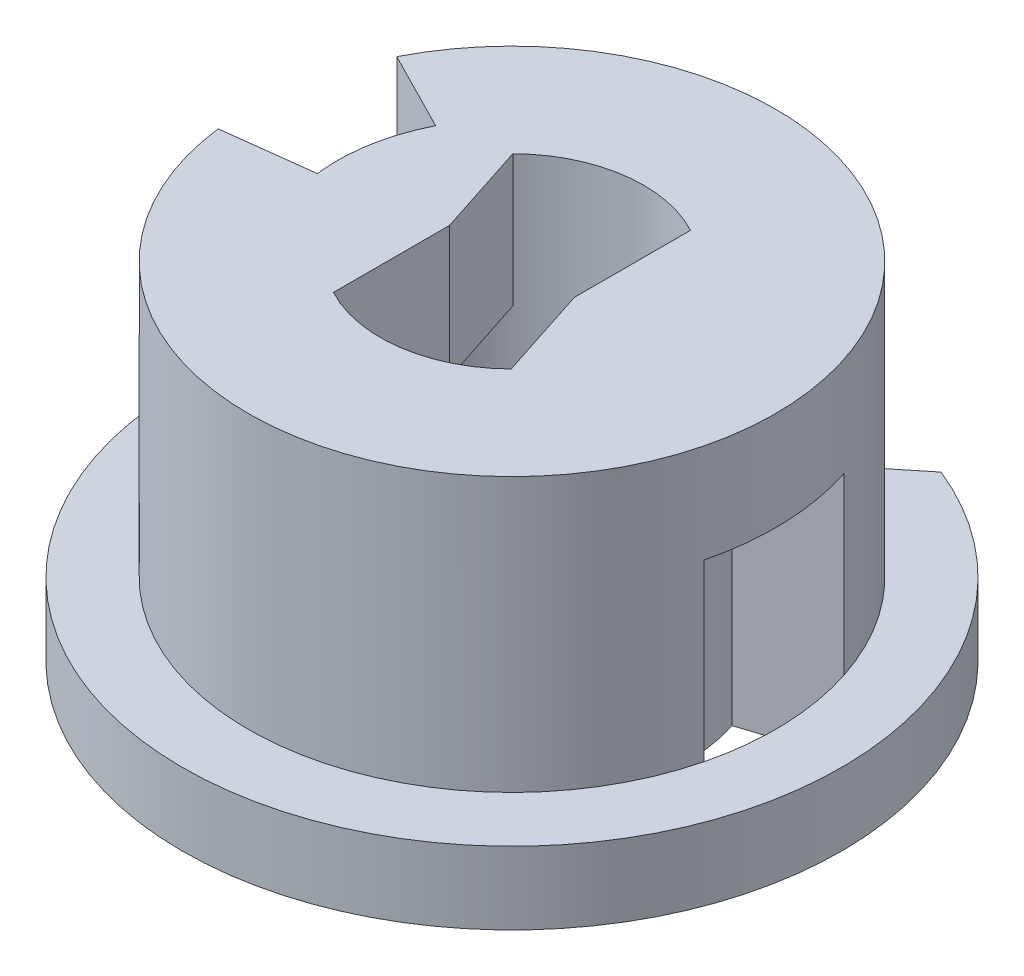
ISO-10303-21;
HEADER;
FILE_DESCRIPTION(('STEP AP214'),'2;1');
FILE_NAME('part.step','',(''),(''),'','','');
FILE_SCHEMA(('AUTOMOTIVE_DESIGN { 1 0 10303 214 1 1 1 1 }'));
ENDSEC;
DATA;
#1=APPLICATION_CONTEXT('core data for automotive mechanical design processes');
#2=APPLICATION_PROTOCOL_DEFINITION('international standard','automotive_design',2000,#1);
#3=PRODUCT_CONTEXT('',#1,'mechanical');
#4=PRODUCT('Part','Part','',(#3));
#5=PRODUCT_RELATED_PRODUCT_CATEGORY('part','',(#4));
#6=PRODUCT_DEFINITION_FORMATION('','',#4);
#7=PRODUCT_DEFINITION_CONTEXT('part definition',#1,'design');
#8=PRODUCT_DEFINITION('design','',#6,#7);
#9=PRODUCT_DEFINITION_SHAPE('','',#8);
#10=(LENGTH_UNIT() NAMED_UNIT(*) SI_UNIT(.MILLI.,.METRE.));
#11=(NAMED_UNIT(*) PLANE_ANGLE_UNIT() SI_UNIT($,.RADIAN.));
#12=(NAMED_UNIT(*) SI_UNIT($,.STERADIAN.) SOLID_ANGLE_UNIT());
#13=UNCERTAINTY_MEASURE_WITH_UNIT(LENGTH_MEASURE(1.E-05),#10,'distance_accuracy_value','');
#14=(GEOMETRIC_REPRESENTATION_CONTEXT(3) GLOBAL_UNCERTAINTY_ASSIGNED_CONTEXT((#13)) GLOBAL_UNIT_ASSIGNED_CONTEXT((#10,
#11,#12)) REPRESENTATION_CONTEXT('',''));
#15=CARTESIAN_POINT('',(0.,0.,0.));
#16=DIRECTION('',(0.,0.,1.));
#17=DIRECTION('',(1.,0.,0.));
#18=AXIS2_PLACEMENT_3D('',#15,#16,#17);
#19=CARTESIAN_POINT('',(0.,6.5,0.));
#20=DIRECTION('',(0.,-1.,0.));
#21=DIRECTION('',(0.,0.,-1.));
#22=AXIS2_PLACEMENT_3D('',#19,#20,#21);
#23=PLANE('',#22);
#24=DIRECTION('',(0.,0.,-1.));
#25=VECTOR('',#24,1.);
#26=CARTESIAN_POINT('',(-1.89263200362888,6.5,0.));
#27=LINE('',#26,#25);
#28=CARTESIAN_POINT('',(-1.89263200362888,6.5,3.52391034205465));
#29=VERTEX_POINT('',#28);
#30=CARTESIAN_POINT('',(-1.89263200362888,6.5,0.));
#31=VERTEX_POINT('',#30);
#32=EDGE_CURVE('E12',#29,#31,#27,.T.);
#33=ORIENTED_EDGE('',*,*,#32,.F.);
#34=CARTESIAN_POINT('',(0.,6.5,0.));
#35=DIRECTION('',(0.,-1.,0.));
#36=DIRECTION('',(0.,0.,-1.));
#37=AXIS2_PLACEMENT_3D('',#34,#35,#36);
#38=CIRCLE('',#37,4.);
#39=CARTESIAN_POINT('',(-2.81574572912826,6.5,-2.84105191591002));
#40=VERTEX_POINT('',#39);
#41=EDGE_CURVE('E659',#29,#40,#38,.T.);
#42=ORIENTED_EDGE('',*,*,#41,.T.);
#43=DIRECTION('',(-0.309016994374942,0.,-0.951056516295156));
#44=VECTOR('',#43,1.);
#45=CARTESIAN_POINT('',(-1.71190172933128,6.5,0.556230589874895));
#46=LINE('',#45,#44);
#47=EDGE_CURVE('E398',#31,#40,#46,.T.);
#48=ORIENTED_EDGE('',*,*,#47,.F.);
#49=EDGE_LOOP('',(#33,#42,#48));
#50=FACE_BOUND('',#49,.T.);
#51=ADVANCED_FACE('F390',(#50),#23,.T.);
#52=CARTESIAN_POINT('',(0.,2.2,0.));
#53=DIRECTION('',(0.,1.,0.));
#54=DIRECTION('',(0.,0.,1.));
#55=AXIS2_PLACEMENT_3D('',#52,#53,#54);
#56=PLANE('',#55);
#57=CARTESIAN_POINT('',(0.,2.2,0.));
#58=DIRECTION('',(0.,1.,0.));
#59=DIRECTION('',(0.,0.,1.));
#60=AXIS2_PLACEMENT_3D('',#57,#58,#59);
#61=CIRCLE('',#60,10.);
#62=CARTESIAN_POINT('',(-7.09145243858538,2.2,-7.05062424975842));
#63=VERTEX_POINT('',#62);
#64=CARTESIAN_POINT('',(3.74606593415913,2.2,-9.27183854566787));
#65=VERTEX_POINT('',#64);
#66=EDGE_CURVE('E727',#63,#65,#61,.T.);
#67=ORIENTED_EDGE('',*,*,#66,.T.);
#68=DIRECTION('',(-0.777145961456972,0.,0.629320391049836));
#69=VECTOR('',#68,1.);
#70=CARTESIAN_POINT('',(-3.05100579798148,2.2,-3.7676783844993));
#71=LINE('',#70,#69);
#72=CARTESIAN_POINT('',(1.89447433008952,2.2,-7.77244922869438));
#73=VERTEX_POINT('',#72);
#74=EDGE_CURVE('E682',#65,#73,#71,.T.);
#75=ORIENTED_EDGE('',*,*,#74,.T.);
#76=CARTESIAN_POINT('',(0.,2.2,0.));
#77=DIRECTION('',(0.,1.,0.));
#78=DIRECTION('',(0.,0.,1.));
#79=AXIS2_PLACEMENT_3D('',#76,#77,#78);
#80=CIRCLE('',#79,8.);
#81=CARTESIAN_POINT('',(7.60845213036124,2.2,-2.47213595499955));
#82=VERTEX_POINT('',#81);
#83=EDGE_CURVE('E721',#82,#73,#80,.T.);
#84=ORIENTED_EDGE('',*,*,#83,.F.);
#85=CARTESIAN_POINT('',(7.76236581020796,2.2,1.93537516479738));
#86=VERTEX_POINT('',#85);
#87=EDGE_CURVE('E564',#86,#82,#80,.T.);
#88=ORIENTED_EDGE('',*,*,#87,.F.);
#89=CARTESIAN_POINT('',(-4.96171125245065,2.2,-6.27546185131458));
#90=VERTEX_POINT('',#89);
#91=EDGE_CURVE('E717',#90,#86,#80,.T.);
#92=ORIENTED_EDGE('',*,*,#91,.F.);
#93=DIRECTION('',(-0.939692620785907,0.,-0.342020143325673));
#94=VECTOR('',#93,1.);
#95=CARTESIAN_POINT('',(1.43648460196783,2.2,-3.94670900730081));
#96=LINE('',#95,#94);
#97=EDGE_CURVE('E711',#90,#63,#96,.T.);
#98=ORIENTED_EDGE('',*,*,#97,.T.);
#99=EDGE_LOOP('',(#67,#75,#84,#88,#92,#98));
#100=FACE_BOUND('',#99,.T.);
#101=ADVANCED_FACE('F793',(#100),#56,.T.);
#102=CARTESIAN_POINT('',(0.,2.2,0.));
#103=DIRECTION('',(0.,-1.,0.));
#104=DIRECTION('',(0.,0.,-1.));
#105=AXIS2_PLACEMENT_3D('',#102,#103,#104);
#106=CYLINDRICAL_SURFACE('',#105,10.);
#107=DIRECTION('',(0.,-1.,0.));
#108=VECTOR('',#107,1.);
#109=CARTESIAN_POINT('',(3.74606593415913,3.2,-9.27183854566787));
#110=LINE('',#109,#108);
#111=CARTESIAN_POINT('',(3.74606593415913,0.,-9.27183854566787));
#112=VERTEX_POINT('',#111);
#113=EDGE_CURVE('E668',#65,#112,#110,.T.);
#114=ORIENTED_EDGE('',*,*,#113,.F.);
#115=ORIENTED_EDGE('',*,*,#66,.F.);
#116=DIRECTION('',(0.,-1.,0.));
#117=VECTOR('',#116,1.);
#118=CARTESIAN_POINT('',(-7.09145243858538,3.2,-7.05062424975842));
#119=LINE('',#118,#117);
#120=CARTESIAN_POINT('',(-7.09145243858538,0.,-7.05062424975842));
#121=VERTEX_POINT('',#120);
#122=EDGE_CURVE('E702',#63,#121,#119,.T.);
#123=ORIENTED_EDGE('',*,*,#122,.T.);
#124=CARTESIAN_POINT('',(0.,0.,0.));
#125=DIRECTION('',(0.,1.,0.));
#126=DIRECTION('',(0.,0.,1.));
#127=AXIS2_PLACEMENT_3D('',#124,#125,#126);
#128=CIRCLE('',#127,10.);
#129=EDGE_CURVE('E724',#121,#112,#128,.T.);
#130=ORIENTED_EDGE('',*,*,#129,.T.);
#131=EDGE_LOOP('',(#114,#115,#123,#130));
#132=FACE_BOUND('',#131,.T.);
#133=ADVANCED_FACE('F392',(#132),#106,.T.);
#134=CARTESIAN_POINT('',(0.,0.,0.));
#135=DIRECTION('',(0.,1.,0.));
#136=DIRECTION('',(0.,0.,1.));
#137=AXIS2_PLACEMENT_3D('',#134,#135,#136);
#138=PLANE('',#137);
#139=DIRECTION('',(0.951056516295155,0.,-0.309016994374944));
#140=VECTOR('',#139,1.);
#141=CARTESIAN_POINT('',(5.04059953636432,0.,-1.6377900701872));
#142=LINE('',#141,#140);
#143=CARTESIAN_POINT('',(5.04059953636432,0.,-1.6377900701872));
#144=VERTEX_POINT('',#143);
#145=CARTESIAN_POINT('',(7.60845213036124,0.,-2.47213595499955));
#146=VERTEX_POINT('',#145);
#147=EDGE_CURVE('E571',#144,#146,#142,.T.);
#148=ORIENTED_EDGE('',*,*,#147,.F.);
#149=CARTESIAN_POINT('',(0.,0.,0.));
#150=DIRECTION('',(0.,1.,0.));
#151=DIRECTION('',(0.,0.,-1.));
#152=AXIS2_PLACEMENT_3D('',#149,#150,#151);
#153=CIRCLE('',#152,5.3);
#154=CARTESIAN_POINT('',(5.14256734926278,0.,1.28218604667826));
#155=VERTEX_POINT('',#154);
#156=EDGE_CURVE('E405',#155,#144,#153,.T.);
#157=ORIENTED_EDGE('',*,*,#156,.F.);
#158=DIRECTION('',(-0.970295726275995,0.,-0.241921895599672));
#159=VECTOR('',#158,1.);
#160=CARTESIAN_POINT('',(5.14256734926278,0.,1.28218604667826));
#161=LINE('',#160,#159);
#162=CARTESIAN_POINT('',(7.76236581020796,0.,1.93537516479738));
#163=VERTEX_POINT('',#162);
#164=EDGE_CURVE('E578',#163,#155,#161,.T.);
#165=ORIENTED_EDGE('',*,*,#164,.F.);
#166=CARTESIAN_POINT('',(0.,0.,0.));
#167=DIRECTION('',(0.,-1.,0.));
#168=DIRECTION('',(0.,0.,-1.));
#169=AXIS2_PLACEMENT_3D('',#166,#167,#168);
#170=CIRCLE('',#169,8.);
#171=EDGE_CURVE('E561',#146,#163,#170,.T.);
#172=ORIENTED_EDGE('',*,*,#171,.F.);
#173=EDGE_LOOP('',(#148,#157,#165,#172));
#174=FACE_BOUND('',#173,.T.);
#175=CARTESIAN_POINT('',(0.,0.,0.));
#176=DIRECTION('',(0.,-1.,0.));
#177=DIRECTION('',(0.,0.,-1.));
#178=AXIS2_PLACEMENT_3D('',#175,#176,#177);
#179=CIRCLE('',#178,4.);
#180=CARTESIAN_POINT('',(0.,0.,-4.));
#181=VERTEX_POINT('',#180);
#182=EDGE_CURVE('E646',#181,#181,#179,.T.);
#183=ORIENTED_EDGE('',*,*,#182,.F.);
#184=EDGE_LOOP('',(#183));
#185=FACE_BOUND('',#184,.T.);
#186=DIRECTION('',(0.777145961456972,0.,-0.629320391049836));
#187=VECTOR('',#186,1.);
#188=CARTESIAN_POINT('',(7.7777832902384,0.,-12.536658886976));
#189=LINE('',#188,#187);
#190=CARTESIAN_POINT('',(0.340457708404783,0.,-6.51403138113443));
#191=VERTEX_POINT('',#190);
#192=EDGE_CURVE('E667',#191,#112,#189,.T.);
#193=ORIENTED_EDGE('',*,*,#192,.T.);
#194=ORIENTED_EDGE('',*,*,#129,.F.);
#195=DIRECTION('',(0.939692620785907,0.,0.342020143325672));
#196=VECTOR('',#195,1.);
#197=CARTESIAN_POINT('',(-5.67963105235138,0.,-6.53676328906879));
#198=LINE('',#197,#196);
#199=CARTESIAN_POINT('',(-4.15372438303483,0.,-5.98137868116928));
#200=VERTEX_POINT('',#199);
#201=EDGE_CURVE('E693',#121,#200,#198,.T.);
#202=ORIENTED_EDGE('',*,*,#201,.T.);
#203=DIRECTION('',(0.342020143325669,0.,-0.939692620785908));
#204=VECTOR('',#203,1.);
#205=CARTESIAN_POINT('',(1.5259066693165,0.,-21.5860367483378));
#206=LINE('',#205,#204);
#207=CARTESIAN_POINT('',(-2.92862723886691,0.,-9.34730542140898));
#208=VERTEX_POINT('',#207);
#209=EDGE_CURVE('E690',#200,#208,#206,.T.);
#210=ORIENTED_EDGE('',*,*,#209,.T.);
#211=CARTESIAN_POINT('',(-2.45878092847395,0.,-9.17629534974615));
#212=DIRECTION('',(0.,-1.,0.));
#213=DIRECTION('',(0.,0.,-1.));
#214=AXIS2_PLACEMENT_3D('',#211,#212,#213);
#215=CIRCLE('',#214,0.5);
#216=CARTESIAN_POINT('',(-2.07020794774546,0.,-9.49095554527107));
#217=VERTEX_POINT('',#216);
#218=EDGE_CURVE('E687',#217,#208,#215,.F.);
#219=ORIENTED_EDGE('',*,*,#218,.F.);
#220=DIRECTION('',(-0.629320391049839,0.,-0.77714596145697));
#221=VECTOR('',#220,1.);
#222=CARTESIAN_POINT('',(-7.43732558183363,0.,-16.1187938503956));
#223=LINE('',#222,#221);
#224=EDGE_CURVE('E675',#191,#217,#223,.T.);
#225=ORIENTED_EDGE('',*,*,#224,.F.);
#226=EDGE_LOOP('',(#193,#194,#202,#210,#219,#225));
#227=FACE_BOUND('',#226,.T.);
#228=ADVANCED_FACE('F575',(#174,#185,#227),#138,.F.);
#229=DIRECTION('',(0.629320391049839,0.,0.77714596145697));
#230=VECTOR('',#229,1.);
#231=CARTESIAN_POINT('',(3.39146350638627,2.2,-2.74635299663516));
#232=LINE('',#231,#230);
#233=CARTESIAN_POINT('',(-2.07020794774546,2.2,-9.49095554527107));
#234=VERTEX_POINT('',#233);
#235=CARTESIAN_POINT('',(-0.828059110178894,2.2,-7.9570294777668));
#236=VERTEX_POINT('',#235);
#237=EDGE_CURVE('E685',#234,#236,#232,.T.);
#238=ORIENTED_EDGE('',*,*,#237,.F.);
#239=CARTESIAN_POINT('',(-2.45878092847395,2.2,-9.17629534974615));
#240=DIRECTION('',(0.,1.,0.));
#241=DIRECTION('',(0.,0.,1.));
#242=AXIS2_PLACEMENT_3D('',#239,#240,#241);
#243=CIRCLE('',#242,0.5);
#244=CARTESIAN_POINT('',(-2.92862723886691,2.2,-9.34730542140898));
#245=VERTEX_POINT('',#244);
#246=EDGE_CURVE('E714',#245,#234,#243,.F.);
#247=ORIENTED_EDGE('',*,*,#246,.F.);
#248=DIRECTION('',(-0.342020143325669,0.,0.939692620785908));
#249=VECTOR('',#248,1.);
#250=CARTESIAN_POINT('',(-5.59020898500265,2.2,-2.03466967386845));
#251=LINE('',#250,#249);
#252=CARTESIAN_POINT('',(-3.76081095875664,2.2,-7.0608994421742));
#253=VERTEX_POINT('',#252);
#254=EDGE_CURVE('E705',#245,#253,#251,.T.);
#255=ORIENTED_EDGE('',*,*,#254,.T.);
#256=EDGE_CURVE('E716',#236,#253,#80,.T.);
#257=ORIENTED_EDGE('',*,*,#256,.F.);
#258=EDGE_LOOP('',(#238,#247,#255,#257));
#259=FACE_BOUND('',#258,.T.);
#260=ADVANCED_FACE('F799',(#259),#56,.T.);
#261=CARTESIAN_POINT('',(0.,10.5,0.));
#262=DIRECTION('',(0.,-1.,0.));
#263=DIRECTION('',(0.,0.,-1.));
#264=AXIS2_PLACEMENT_3D('',#261,#262,#263);
#265=CYLINDRICAL_SURFACE('',#264,8.);
#266=ORIENTED_EDGE('',*,*,#91,.T.);
#267=DIRECTION('',(0.,-1.,0.));
#268=VECTOR('',#267,1.);
#269=CARTESIAN_POINT('',(7.76236581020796,7.5,1.93537516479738));
#270=LINE('',#269,#268);
#271=CARTESIAN_POINT('',(7.76236581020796,7.5,1.93537516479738));
#272=VERTEX_POINT('',#271);
#273=EDGE_CURVE('E594',#272,#86,#270,.T.);
#274=ORIENTED_EDGE('',*,*,#273,.F.);
#275=CARTESIAN_POINT('',(0.,7.5,0.));
#276=DIRECTION('',(0.,-1.,0.));
#277=DIRECTION('',(0.,0.,-1.));
#278=AXIS2_PLACEMENT_3D('',#275,#276,#277);
#279=CIRCLE('',#278,8.);
#280=CARTESIAN_POINT('',(7.60845213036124,7.5,-2.47213595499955));
#281=VERTEX_POINT('',#280);
#282=EDGE_CURVE('E586',#281,#272,#279,.T.);
#283=ORIENTED_EDGE('',*,*,#282,.F.);
#284=DIRECTION('',(0.,-1.,0.));
#285=VECTOR('',#284,1.);
#286=CARTESIAN_POINT('',(7.60845213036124,7.5,-2.47213595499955));
#287=LINE('',#286,#285);
#288=EDGE_CURVE('E567',#281,#82,#287,.T.);
#289=ORIENTED_EDGE('',*,*,#288,.T.);
#290=ORIENTED_EDGE('',*,*,#83,.T.);
#291=DIRECTION('',(0.,-1.,0.));
#292=VECTOR('',#291,1.);
#293=CARTESIAN_POINT('',(1.89447433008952,10.5,-7.77244922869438));
#294=LINE('',#293,#292);
#295=CARTESIAN_POINT('',(1.89447433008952,3.2,-7.77244922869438));
#296=VERTEX_POINT('',#295);
#297=EDGE_CURVE('E740',#296,#73,#294,.T.);
#298=ORIENTED_EDGE('',*,*,#297,.F.);
#299=CARTESIAN_POINT('',(0.,3.2,0.));
#300=DIRECTION('',(0.,-1.,0.));
#301=DIRECTION('',(0.,0.,-1.));
#302=AXIS2_PLACEMENT_3D('',#299,#300,#301);
#303=CIRCLE('',#302,8.);
#304=CARTESIAN_POINT('',(-0.828059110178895,3.2,-7.9570294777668));
#305=VERTEX_POINT('',#304);
#306=EDGE_CURVE('E738',#305,#296,#303,.T.);
#307=ORIENTED_EDGE('',*,*,#306,.F.);
#308=DIRECTION('',(0.,-1.,0.));
#309=VECTOR('',#308,1.);
#310=CARTESIAN_POINT('',(-0.828059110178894,10.5,-7.9570294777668));
#311=LINE('',#310,#309);
#312=EDGE_CURVE('E743',#305,#236,#311,.T.);
#313=ORIENTED_EDGE('',*,*,#312,.T.);
#314=ORIENTED_EDGE('',*,*,#256,.T.);
#315=DIRECTION('',(0.,-1.,0.));
#316=VECTOR('',#315,1.);
#317=CARTESIAN_POINT('',(-3.76081095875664,10.5,-7.0608994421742));
#318=LINE('',#317,#316);
#319=CARTESIAN_POINT('',(-3.76081095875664,3.2,-7.0608994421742));
#320=VERTEX_POINT('',#319);
#321=EDGE_CURVE('E732',#320,#253,#318,.T.);
#322=ORIENTED_EDGE('',*,*,#321,.F.);
#323=CARTESIAN_POINT('',(0.,3.2,0.));
#324=DIRECTION('',(0.,-1.,0.));
#325=DIRECTION('',(0.,0.,-1.));
#326=AXIS2_PLACEMENT_3D('',#323,#324,#325);
#327=CIRCLE('',#326,8.);
#328=CARTESIAN_POINT('',(-4.96171125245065,3.2,-6.27546185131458));
#329=VERTEX_POINT('',#328);
#330=EDGE_CURVE('E730',#329,#320,#327,.T.);
#331=ORIENTED_EDGE('',*,*,#330,.F.);
#332=DIRECTION('',(0.,-1.,0.));
#333=VECTOR('',#332,1.);
#334=CARTESIAN_POINT('',(-4.96171125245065,10.5,-6.27546185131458));
#335=LINE('',#334,#333);
#336=EDGE_CURVE('E735',#90,#329,#335,.F.);
#337=ORIENTED_EDGE('',*,*,#336,.F.);
#338=EDGE_LOOP('',(#266,#274,#283,#289,#290,#298,#307,#313,#314,#322,#331,#337));
#339=FACE_BOUND('',#338,.T.);
#340=CARTESIAN_POINT('',(0.,10.5,0.));
#341=DIRECTION('',(0.,1.,0.));
#342=DIRECTION('',(0.,0.,1.));
#343=AXIS2_PLACEMENT_3D('',#340,#341,#342);
#344=CIRCLE('',#343,8.);
#345=CARTESIAN_POINT('',(-7.94036921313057,10.5,0.974954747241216));
#346=VERTEX_POINT('',#345);
#347=CARTESIAN_POINT('',(-7.12805219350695,10.5,-3.63192399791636));
#348=VERTEX_POINT('',#347);
#349=EDGE_CURVE('E720',#346,#348,#344,.T.);
#350=ORIENTED_EDGE('',*,*,#349,.F.);
#351=DIRECTION('',(0.,1.,0.));
#352=VECTOR('',#351,1.);
#353=CARTESIAN_POINT('',(-7.94036921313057,5.5,0.974954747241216));
#354=LINE('',#353,#352);
#355=CARTESIAN_POINT('',(-7.94036921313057,5.5,0.974954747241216));
#356=VERTEX_POINT('',#355);
#357=EDGE_CURVE('E620',#356,#346,#354,.T.);
#358=ORIENTED_EDGE('',*,*,#357,.F.);
#359=CARTESIAN_POINT('',(0.,5.5,0.));
#360=DIRECTION('',(0.,1.,0.));
#361=DIRECTION('',(0.,0.,1.));
#362=AXIS2_PLACEMENT_3D('',#359,#360,#361);
#363=CIRCLE('',#362,8.);
#364=CARTESIAN_POINT('',(-7.12805219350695,5.5,-3.63192399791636));
#365=VERTEX_POINT('',#364);
#366=EDGE_CURVE('E611',#365,#356,#363,.T.);
#367=ORIENTED_EDGE('',*,*,#366,.F.);
#368=DIRECTION('',(0.,1.,0.));
#369=VECTOR('',#368,1.);
#370=CARTESIAN_POINT('',(-7.12805219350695,5.5,-3.63192399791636));
#371=LINE('',#370,#369);
#372=EDGE_CURVE('E622',#365,#348,#371,.T.);
#373=ORIENTED_EDGE('',*,*,#372,.T.);
#374=EDGE_LOOP('',(#350,#358,#367,#373));
#375=FACE_BOUND('',#374,.T.);
#376=ADVANCED_FACE('F808',(#339,#375),#265,.T.);
#377=CARTESIAN_POINT('',(0.,10.5,0.));
#378=DIRECTION('',(0.,1.,0.));
#379=DIRECTION('',(0.,0.,1.));
#380=AXIS2_PLACEMENT_3D('',#377,#378,#379);
#381=PLANE('',#380);
#382=DIRECTION('',(0.992546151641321,0.,-0.121869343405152));
#383=VECTOR('',#382,1.);
#384=CARTESIAN_POINT('',(-5.260494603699,10.5,0.645907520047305));
#385=LINE('',#384,#383);
#386=CARTESIAN_POINT('',(-5.260494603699,10.5,0.645907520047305));
#387=VERTEX_POINT('',#386);
#388=EDGE_CURVE('E602',#346,#387,#385,.T.);
#389=ORIENTED_EDGE('',*,*,#388,.F.);
#390=ORIENTED_EDGE('',*,*,#349,.T.);
#391=DIRECTION('',(-0.891006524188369,0.,-0.453990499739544));
#392=VECTOR('',#391,1.);
#393=CARTESIAN_POINT('',(-4.72233457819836,10.5,-2.40614964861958));
#394=LINE('',#393,#392);
#395=CARTESIAN_POINT('',(-4.72233457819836,10.5,-2.40614964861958));
#396=VERTEX_POINT('',#395);
#397=EDGE_CURVE('E600',#396,#348,#394,.T.);
#398=ORIENTED_EDGE('',*,*,#397,.F.);
#399=CARTESIAN_POINT('',(0.,10.5,0.));
#400=DIRECTION('',(0.,-1.,0.));
#401=DIRECTION('',(0.,0.,1.));
#402=AXIS2_PLACEMENT_3D('',#399,#400,#401);
#403=CIRCLE('',#402,5.3);
#404=EDGE_CURVE('E593',#387,#396,#403,.T.);
#405=ORIENTED_EDGE('',*,*,#404,.F.);
#406=EDGE_LOOP('',(#389,#390,#398,#405));
#407=FACE_BOUND('',#406,.T.);
#408=CARTESIAN_POINT('',(0.,10.5,0.));
#409=DIRECTION('',(0.,1.,0.));
#410=DIRECTION('',(0.,0.,1.));
#411=AXIS2_PLACEMENT_3D('',#408,#409,#410);
#412=CIRCLE('',#411,4.);
#413=CARTESIAN_POINT('',(-1.89263200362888,10.5,3.52391034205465));
#414=VERTEX_POINT('',#413);
#415=CARTESIAN_POINT('',(2.81574572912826,10.5,2.84105191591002));
#416=VERTEX_POINT('',#415);
#417=EDGE_CURVE('E619',#414,#416,#412,.T.);
#418=ORIENTED_EDGE('',*,*,#417,.F.);
#419=DIRECTION('',(0.,0.,1.));
#420=VECTOR('',#419,1.);
#421=CARTESIAN_POINT('',(-1.89263200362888,10.5,0.));
#422=LINE('',#421,#420);
#423=CARTESIAN_POINT('',(-1.89263200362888,10.5,0.));
#424=VERTEX_POINT('',#423);
#425=EDGE_CURVE('E640',#424,#414,#422,.T.);
#426=ORIENTED_EDGE('',*,*,#425,.F.);
#427=DIRECTION('',(0.309016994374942,0.,0.951056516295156));
#428=VECTOR('',#427,1.);
#429=CARTESIAN_POINT('',(-2.81574572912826,10.5,-2.84105191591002));
#430=LINE('',#429,#428);
#431=CARTESIAN_POINT('',(-2.81574572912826,10.5,-2.84105191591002));
#432=VERTEX_POINT('',#431);
#433=EDGE_CURVE('E637',#432,#424,#430,.T.);
#434=ORIENTED_EDGE('',*,*,#433,.F.);
#435=CARTESIAN_POINT('',(0.,10.5,0.));
#436=DIRECTION('',(0.,1.,0.));
#437=DIRECTION('',(0.,0.,1.));
#438=AXIS2_PLACEMENT_3D('',#435,#436,#437);
#439=CIRCLE('',#438,4.);
#440=CARTESIAN_POINT('',(1.89263200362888,10.5,-3.52391034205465));
#441=VERTEX_POINT('',#440);
#442=EDGE_CURVE('E634',#441,#432,#439,.T.);
#443=ORIENTED_EDGE('',*,*,#442,.F.);
#444=DIRECTION('',(0.,0.,-1.));
#445=VECTOR('',#444,1.);
#446=CARTESIAN_POINT('',(1.89263200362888,10.5,0.));
#447=LINE('',#446,#445);
#448=CARTESIAN_POINT('',(1.89263200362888,10.5,0.));
#449=VERTEX_POINT('',#448);
#450=EDGE_CURVE('E631',#449,#441,#447,.T.);
#451=ORIENTED_EDGE('',*,*,#450,.F.);
#452=DIRECTION('',(-0.309016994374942,0.,-0.951056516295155));
#453=VECTOR('',#452,1.);
#454=CARTESIAN_POINT('',(2.81574572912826,10.5,2.84105191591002));
#455=LINE('',#454,#453);
#456=EDGE_CURVE('E628',#416,#449,#455,.T.);
#457=ORIENTED_EDGE('',*,*,#456,.F.);
#458=EDGE_LOOP('',(#418,#426,#434,#443,#451,#457));
#459=FACE_BOUND('',#458,.T.);
#460=ADVANCED_FACE('F775',(#407,#459),#381,.T.);
#461=CARTESIAN_POINT('',(0.,3.2,-22.1414213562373));
#462=DIRECTION('',(0.,-1.,0.));
#463=DIRECTION('',(0.,0.,-1.));
#464=AXIS2_PLACEMENT_3D('',#461,#462,#463);
#465=PLANE('',#464);
#466=ORIENTED_EDGE('',*,*,#330,.T.);
#467=DIRECTION('',(0.342020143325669,0.,-0.939692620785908));
#468=VECTOR('',#467,1.);
#469=CARTESIAN_POINT('',(1.5259066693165,3.2,-21.5860367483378));
#470=LINE('',#469,#468);
#471=CARTESIAN_POINT('',(-4.15372438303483,3.2,-5.98137868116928));
#472=VERTEX_POINT('',#471);
#473=EDGE_CURVE('E696',#472,#320,#470,.T.);
#474=ORIENTED_EDGE('',*,*,#473,.F.);
#475=DIRECTION('',(0.939692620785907,0.,0.342020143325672));
#476=VECTOR('',#475,1.);
#477=CARTESIAN_POINT('',(-5.67963105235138,3.2,-6.53676328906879));
#478=LINE('',#477,#476);
#479=EDGE_CURVE('E699',#329,#472,#478,.T.);
#480=ORIENTED_EDGE('',*,*,#479,.F.);
#481=EDGE_LOOP('',(#466,#474,#480));
#482=FACE_BOUND('',#481,.T.);
#483=ADVANCED_FACE('F847',(#482),#465,.T.);
#484=CARTESIAN_POINT('',(-5.67963105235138,3.2,-6.53676328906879));
#485=DIRECTION('',(0.342020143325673,0.,-0.939692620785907));
#486=DIRECTION('',(-0.939692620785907,0.,-0.342020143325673));
#487=AXIS2_PLACEMENT_3D('',#484,#485,#486);
#488=PLANE('',#487);
#489=ORIENTED_EDGE('',*,*,#336,.T.);
#490=ORIENTED_EDGE('',*,*,#479,.T.);
#491=DIRECTION('',(0.,-1.,0.));
#492=VECTOR('',#491,1.);
#493=CARTESIAN_POINT('',(-4.15372438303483,3.2,-5.98137868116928));
#494=LINE('',#493,#492);
#495=EDGE_CURVE('E706',#472,#200,#494,.T.);
#496=ORIENTED_EDGE('',*,*,#495,.T.);
#497=ORIENTED_EDGE('',*,*,#201,.F.);
#498=ORIENTED_EDGE('',*,*,#122,.F.);
#499=ORIENTED_EDGE('',*,*,#97,.F.);
#500=EDGE_LOOP('',(#489,#490,#496,#497,#498,#499));
#501=FACE_BOUND('',#500,.T.);
#502=ADVANCED_FACE('F849',(#501),#488,.T.);
#503=CARTESIAN_POINT('',(1.5259066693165,3.2,-21.5860367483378));
#504=DIRECTION('',(-0.939692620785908,0.,-0.342020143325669));
#505=DIRECTION('',(-0.342020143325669,0.,0.939692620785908));
#506=AXIS2_PLACEMENT_3D('',#503,#504,#505);
#507=PLANE('',#506);
#508=DIRECTION('',(0.,-1.,0.));
#509=VECTOR('',#508,1.);
#510=CARTESIAN_POINT('',(-2.92862723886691,3.2,-9.34730542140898));
#511=LINE('',#510,#509);
#512=EDGE_CURVE('E701',#245,#208,#511,.T.);
#513=ORIENTED_EDGE('',*,*,#512,.T.);
#514=ORIENTED_EDGE('',*,*,#209,.F.);
#515=ORIENTED_EDGE('',*,*,#495,.F.);
#516=ORIENTED_EDGE('',*,*,#473,.T.);
#517=ORIENTED_EDGE('',*,*,#321,.T.);
#518=ORIENTED_EDGE('',*,*,#254,.F.);
#519=EDGE_LOOP('',(#513,#514,#515,#516,#517,#518));
#520=FACE_BOUND('',#519,.T.);
#521=ADVANCED_FACE('F840',(#520),#507,.T.);
#522=CARTESIAN_POINT('',(-2.45878092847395,3.2,-9.17629534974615));
#523=DIRECTION('',(0.,-1.,0.));
#524=DIRECTION('',(0.,0.,-1.));
#525=AXIS2_PLACEMENT_3D('',#522,#523,#524);
#526=CYLINDRICAL_SURFACE('',#525,0.5);
#527=ORIENTED_EDGE('',*,*,#246,.T.);
#528=DIRECTION('',(0.,-1.,0.));
#529=VECTOR('',#528,1.);
#530=CARTESIAN_POINT('',(-2.07020794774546,3.2,-9.49095554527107));
#531=LINE('',#530,#529);
#532=EDGE_CURVE('E664',#234,#217,#531,.T.);
#533=ORIENTED_EDGE('',*,*,#532,.T.);
#534=ORIENTED_EDGE('',*,*,#218,.T.);
#535=ORIENTED_EDGE('',*,*,#512,.F.);
#536=EDGE_LOOP('',(#527,#533,#534,#535));
#537=FACE_BOUND('',#536,.T.);
#538=ADVANCED_FACE('F838',(#537),#526,.T.);
#539=CARTESIAN_POINT('',(0.,3.2,-22.1414213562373));
#540=DIRECTION('',(0.,-1.,0.));
#541=DIRECTION('',(0.,0.,-1.));
#542=AXIS2_PLACEMENT_3D('',#539,#540,#541);
#543=PLANE('',#542);
#544=ORIENTED_EDGE('',*,*,#306,.T.);
#545=DIRECTION('',(0.777145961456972,0.,-0.629320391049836));
#546=VECTOR('',#545,1.);
#547=CARTESIAN_POINT('',(7.7777832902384,3.2,-12.536658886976));
#548=LINE('',#547,#546);
#549=CARTESIAN_POINT('',(0.340457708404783,3.2,-6.51403138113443));
#550=VERTEX_POINT('',#549);
#551=EDGE_CURVE('E670',#550,#296,#548,.T.);
#552=ORIENTED_EDGE('',*,*,#551,.F.);
#553=DIRECTION('',(-0.629320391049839,0.,-0.77714596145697));
#554=VECTOR('',#553,1.);
#555=CARTESIAN_POINT('',(-7.43732558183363,3.2,-16.1187938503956));
#556=LINE('',#555,#554);
#557=EDGE_CURVE('E663',#550,#305,#556,.T.);
#558=ORIENTED_EDGE('',*,*,#557,.T.);
#559=EDGE_LOOP('',(#544,#552,#558));
#560=FACE_BOUND('',#559,.T.);
#561=ADVANCED_FACE('F829',(#560),#543,.T.);
#562=CARTESIAN_POINT('',(-7.43732558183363,3.2,-16.1187938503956));
#563=DIRECTION('',(-0.77714596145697,0.,0.629320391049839));
#564=DIRECTION('',(0.629320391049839,0.,0.77714596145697));
#565=AXIS2_PLACEMENT_3D('',#562,#563,#564);
#566=PLANE('',#565);
#567=ORIENTED_EDGE('',*,*,#237,.T.);
#568=ORIENTED_EDGE('',*,*,#312,.F.);
#569=ORIENTED_EDGE('',*,*,#557,.F.);
#570=DIRECTION('',(0.,-1.,0.));
#571=VECTOR('',#570,1.);
#572=CARTESIAN_POINT('',(0.340457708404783,3.2,-6.51403138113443));
#573=LINE('',#572,#571);
#574=EDGE_CURVE('E671',#550,#191,#573,.T.);
#575=ORIENTED_EDGE('',*,*,#574,.T.);
#576=ORIENTED_EDGE('',*,*,#224,.T.);
#577=ORIENTED_EDGE('',*,*,#532,.F.);
#578=EDGE_LOOP('',(#567,#568,#569,#575,#576,#577));
#579=FACE_BOUND('',#578,.T.);
#580=ADVANCED_FACE('F821',(#579),#566,.F.);
#581=CARTESIAN_POINT('',(7.7777832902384,3.2,-12.536658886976));
#582=DIRECTION('',(-0.629320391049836,0.,-0.777145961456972));
#583=DIRECTION('',(-0.777145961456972,0.,0.629320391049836));
#584=AXIS2_PLACEMENT_3D('',#581,#582,#583);
#585=PLANE('',#584);
#586=ORIENTED_EDGE('',*,*,#113,.T.);
#587=ORIENTED_EDGE('',*,*,#192,.F.);
#588=ORIENTED_EDGE('',*,*,#574,.F.);
#589=ORIENTED_EDGE('',*,*,#551,.T.);
#590=ORIENTED_EDGE('',*,*,#297,.T.);
#591=ORIENTED_EDGE('',*,*,#74,.F.);
#592=EDGE_LOOP('',(#586,#587,#588,#589,#590,#591));
#593=FACE_BOUND('',#592,.T.);
#594=ADVANCED_FACE('F788',(#593),#585,.T.);
#595=CARTESIAN_POINT('',(0.,6.5,0.));
#596=DIRECTION('',(0.,-1.,0.));
#597=DIRECTION('',(0.,0.,-1.));
#598=AXIS2_PLACEMENT_3D('',#595,#596,#597);
#599=CYLINDRICAL_SURFACE('',#598,4.);
#600=ORIENTED_EDGE('',*,*,#182,.T.);
#601=EDGE_LOOP('',(#600));
#602=FACE_BOUND('',#601,.T.);
#603=CARTESIAN_POINT('',(1.89263200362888,6.5,-3.52391034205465));
#604=VERTEX_POINT('',#603);
#605=CARTESIAN_POINT('',(2.81574572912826,6.5,2.84105191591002));
#606=VERTEX_POINT('',#605);
#607=EDGE_CURVE('E660',#604,#606,#38,.T.);
#608=ORIENTED_EDGE('',*,*,#607,.F.);
#609=DIRECTION('',(0.,1.,0.));
#610=VECTOR('',#609,1.);
#611=CARTESIAN_POINT('',(1.89263200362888,0.,-3.52391034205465));
#612=LINE('',#611,#610);
#613=EDGE_CURVE('E651',#604,#441,#612,.T.);
#614=ORIENTED_EDGE('',*,*,#613,.T.);
#615=ORIENTED_EDGE('',*,*,#442,.T.);
#616=DIRECTION('',(0.,1.,0.));
#617=VECTOR('',#616,1.);
#618=CARTESIAN_POINT('',(-2.81574572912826,0.,-2.84105191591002));
#619=LINE('',#618,#617);
#620=EDGE_CURVE('E649',#40,#432,#619,.T.);
#621=ORIENTED_EDGE('',*,*,#620,.F.);
#622=ORIENTED_EDGE('',*,*,#41,.F.);
#623=DIRECTION('',(0.,1.,0.));
#624=VECTOR('',#623,1.);
#625=CARTESIAN_POINT('',(-1.89263200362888,0.,3.52391034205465));
#626=LINE('',#625,#624);
#627=EDGE_CURVE('E644',#29,#414,#626,.T.);
#628=ORIENTED_EDGE('',*,*,#627,.T.);
#629=ORIENTED_EDGE('',*,*,#417,.T.);
#630=DIRECTION('',(0.,1.,0.));
#631=VECTOR('',#630,1.);
#632=CARTESIAN_POINT('',(2.81574572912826,0.,2.84105191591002));
#633=LINE('',#632,#631);
#634=EDGE_CURVE('E643',#606,#416,#633,.T.);
#635=ORIENTED_EDGE('',*,*,#634,.F.);
#636=EDGE_LOOP('',(#608,#614,#615,#621,#622,#628,#629,#635));
#637=FACE_BOUND('',#636,.T.);
#638=ADVANCED_FACE('F761',(#602,#637),#599,.F.);
#639=DIRECTION('',(0.,0.,1.));
#640=VECTOR('',#639,1.);
#641=CARTESIAN_POINT('',(1.89263200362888,6.5,0.));
#642=LINE('',#641,#640);
#643=CARTESIAN_POINT('',(1.89263200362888,6.5,0.));
#644=VERTEX_POINT('',#643);
#645=EDGE_CURVE('E748',#604,#644,#642,.T.);
#646=ORIENTED_EDGE('',*,*,#645,.F.);
#647=ORIENTED_EDGE('',*,*,#607,.T.);
#648=DIRECTION('',(0.309016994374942,0.,0.951056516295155));
#649=VECTOR('',#648,1.);
#650=CARTESIAN_POINT('',(1.71190172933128,6.5,-0.556230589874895));
#651=LINE('',#650,#649);
#652=EDGE_CURVE('E746',#644,#606,#651,.T.);
#653=ORIENTED_EDGE('',*,*,#652,.F.);
#654=EDGE_LOOP('',(#646,#647,#653));
#655=FACE_BOUND('',#654,.T.);
#656=ADVANCED_FACE('F780',(#655),#23,.T.);
#657=CARTESIAN_POINT('',(-1.89263200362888,0.,0.));
#658=DIRECTION('',(-1.,0.,0.));
#659=DIRECTION('',(0.,0.,1.));
#660=AXIS2_PLACEMENT_3D('',#657,#658,#659);
#661=PLANE('',#660);
#662=ORIENTED_EDGE('',*,*,#32,.T.);
#663=DIRECTION('',(0.,1.,0.));
#664=VECTOR('',#663,1.);
#665=CARTESIAN_POINT('',(-1.89263200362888,0.,0.));
#666=LINE('',#665,#664);
#667=EDGE_CURVE('E647',#31,#424,#666,.T.);
#668=ORIENTED_EDGE('',*,*,#667,.T.);
#669=ORIENTED_EDGE('',*,*,#425,.T.);
#670=ORIENTED_EDGE('',*,*,#627,.F.);
#671=EDGE_LOOP('',(#662,#668,#669,#670));
#672=FACE_BOUND('',#671,.T.);
#673=ADVANCED_FACE('F765',(#672),#661,.F.);
#674=CARTESIAN_POINT('',(-2.81574572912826,0.,-2.84105191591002));
#675=DIRECTION('',(-0.951056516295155,0.,0.309016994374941));
#676=DIRECTION('',(0.309016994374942,0.,0.951056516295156));
#677=AXIS2_PLACEMENT_3D('',#674,#675,#676);
#678=PLANE('',#677);
#679=ORIENTED_EDGE('',*,*,#47,.T.);
#680=ORIENTED_EDGE('',*,*,#620,.T.);
#681=ORIENTED_EDGE('',*,*,#433,.T.);
#682=ORIENTED_EDGE('',*,*,#667,.F.);
#683=EDGE_LOOP('',(#679,#680,#681,#682));
#684=FACE_BOUND('',#683,.T.);
#685=ADVANCED_FACE('F754',(#684),#678,.F.);
#686=CARTESIAN_POINT('',(1.89263200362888,0.,0.));
#687=DIRECTION('',(1.,0.,0.));
#688=DIRECTION('',(0.,0.,-1.));
#689=AXIS2_PLACEMENT_3D('',#686,#687,#688);
#690=PLANE('',#689);
#691=ORIENTED_EDGE('',*,*,#645,.T.);
#692=DIRECTION('',(0.,1.,0.));
#693=VECTOR('',#692,1.);
#694=CARTESIAN_POINT('',(1.89263200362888,0.,0.));
#695=LINE('',#694,#693);
#696=EDGE_CURVE('E653',#644,#449,#695,.T.);
#697=ORIENTED_EDGE('',*,*,#696,.T.);
#698=ORIENTED_EDGE('',*,*,#450,.T.);
#699=ORIENTED_EDGE('',*,*,#613,.F.);
#700=EDGE_LOOP('',(#691,#697,#698,#699));
#701=FACE_BOUND('',#700,.T.);
#702=ADVANCED_FACE('F777',(#701),#690,.F.);
#703=CARTESIAN_POINT('',(2.81574572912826,0.,2.84105191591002));
#704=DIRECTION('',(0.951056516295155,0.,-0.309016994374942));
#705=DIRECTION('',(-0.309016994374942,0.,-0.951056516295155));
#706=AXIS2_PLACEMENT_3D('',#703,#704,#705);
#707=PLANE('',#706);
#708=ORIENTED_EDGE('',*,*,#652,.T.);
#709=ORIENTED_EDGE('',*,*,#634,.T.);
#710=ORIENTED_EDGE('',*,*,#456,.T.);
#711=ORIENTED_EDGE('',*,*,#696,.F.);
#712=EDGE_LOOP('',(#708,#709,#710,#711));
#713=FACE_BOUND('',#712,.T.);
#714=ADVANCED_FACE('F772',(#713),#707,.F.);
#715=CARTESIAN_POINT('',(0.,5.5,0.));
#716=DIRECTION('',(0.,1.,0.));
#717=DIRECTION('',(0.,0.,1.));
#718=AXIS2_PLACEMENT_3D('',#715,#716,#717);
#719=CYLINDRICAL_SURFACE('',#718,5.3);
#720=ORIENTED_EDGE('',*,*,#404,.T.);
#721=DIRECTION('',(0.,1.,0.));
#722=VECTOR('',#721,1.);
#723=CARTESIAN_POINT('',(-4.72233457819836,5.5,-2.40614964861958));
#724=LINE('',#723,#722);
#725=CARTESIAN_POINT('',(-4.72233457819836,5.5,-2.40614964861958));
#726=VERTEX_POINT('',#725);
#727=EDGE_CURVE('E616',#726,#396,#724,.T.);
#728=ORIENTED_EDGE('',*,*,#727,.F.);
#729=CARTESIAN_POINT('',(0.,5.5,0.));
#730=DIRECTION('',(0.,-1.,0.));
#731=DIRECTION('',(0.,0.,1.));
#732=AXIS2_PLACEMENT_3D('',#729,#730,#731);
#733=CIRCLE('',#732,5.3);
#734=CARTESIAN_POINT('',(-5.260494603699,5.5,0.645907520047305));
#735=VERTEX_POINT('',#734);
#736=EDGE_CURVE('E605',#735,#726,#733,.T.);
#737=ORIENTED_EDGE('',*,*,#736,.F.);
#738=DIRECTION('',(0.,1.,0.));
#739=VECTOR('',#738,1.);
#740=CARTESIAN_POINT('',(-5.260494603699,5.5,0.645907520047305));
#741=LINE('',#740,#739);
#742=EDGE_CURVE('E617',#735,#387,#741,.T.);
#743=ORIENTED_EDGE('',*,*,#742,.T.);
#744=EDGE_LOOP('',(#720,#728,#737,#743));
#745=FACE_BOUND('',#744,.T.);
#746=ADVANCED_FACE('F880',(#745),#719,.T.);
#747=CARTESIAN_POINT('',(-5.260494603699,5.5,0.645907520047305));
#748=DIRECTION('',(0.121869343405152,0.,0.992546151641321));
#749=DIRECTION('',(0.992546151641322,0.,-0.121869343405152));
#750=AXIS2_PLACEMENT_3D('',#747,#748,#749);
#751=PLANE('',#750);
#752=ORIENTED_EDGE('',*,*,#388,.T.);
#753=ORIENTED_EDGE('',*,*,#742,.F.);
#754=DIRECTION('',(0.992546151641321,0.,-0.121869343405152));
#755=VECTOR('',#754,1.);
#756=CARTESIAN_POINT('',(-5.260494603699,5.5,0.645907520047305));
#757=LINE('',#756,#755);
#758=EDGE_CURVE('E613',#356,#735,#757,.T.);
#759=ORIENTED_EDGE('',*,*,#758,.F.);
#760=ORIENTED_EDGE('',*,*,#357,.T.);
#761=EDGE_LOOP('',(#752,#753,#759,#760));
#762=FACE_BOUND('',#761,.T.);
#763=ADVANCED_FACE('F877',(#762),#751,.F.);
#764=CARTESIAN_POINT('',(-4.72233457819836,5.5,-2.40614964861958));
#765=DIRECTION('',(0.453990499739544,0.,-0.891006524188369));
#766=DIRECTION('',(-0.891006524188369,0.,-0.453990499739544));
#767=AXIS2_PLACEMENT_3D('',#764,#765,#766);
#768=PLANE('',#767);
#769=ORIENTED_EDGE('',*,*,#397,.T.);
#770=ORIENTED_EDGE('',*,*,#372,.F.);
#771=DIRECTION('',(-0.891006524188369,0.,-0.453990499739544));
#772=VECTOR('',#771,1.);
#773=CARTESIAN_POINT('',(-4.72233457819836,5.5,-2.40614964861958));
#774=LINE('',#773,#772);
#775=EDGE_CURVE('E608',#726,#365,#774,.T.);
#776=ORIENTED_EDGE('',*,*,#775,.F.);
#777=ORIENTED_EDGE('',*,*,#727,.T.);
#778=EDGE_LOOP('',(#769,#770,#776,#777));
#779=FACE_BOUND('',#778,.T.);
#780=ADVANCED_FACE('F875',(#779),#768,.F.);
#781=CARTESIAN_POINT('',(0.,5.5,0.));
#782=DIRECTION('',(0.,1.,0.));
#783=DIRECTION('',(0.,0.,1.));
#784=AXIS2_PLACEMENT_3D('',#781,#782,#783);
#785=PLANE('',#784);
#786=ORIENTED_EDGE('',*,*,#736,.T.);
#787=ORIENTED_EDGE('',*,*,#775,.T.);
#788=ORIENTED_EDGE('',*,*,#366,.T.);
#789=ORIENTED_EDGE('',*,*,#758,.T.);
#790=EDGE_LOOP('',(#786,#787,#788,#789));
#791=FACE_BOUND('',#790,.T.);
#792=ADVANCED_FACE('F868',(#791),#785,.T.);
#793=CARTESIAN_POINT('',(0.,7.5,0.));
#794=DIRECTION('',(0.,-1.,0.));
#795=DIRECTION('',(0.,0.,-1.));
#796=AXIS2_PLACEMENT_3D('',#793,#794,#795);
#797=CYLINDRICAL_SURFACE('',#796,5.3);
#798=ORIENTED_EDGE('',*,*,#156,.T.);
#799=DIRECTION('',(0.,-1.,0.));
#800=VECTOR('',#799,1.);
#801=CARTESIAN_POINT('',(5.04059953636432,7.5,-1.6377900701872));
#802=LINE('',#801,#800);
#803=CARTESIAN_POINT('',(5.04059953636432,7.5,-1.6377900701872));
#804=VERTEX_POINT('',#803);
#805=EDGE_CURVE('E568',#804,#144,#802,.T.);
#806=ORIENTED_EDGE('',*,*,#805,.F.);
#807=CARTESIAN_POINT('',(0.,7.5,0.));
#808=DIRECTION('',(0.,1.,0.));
#809=DIRECTION('',(0.,0.,-1.));
#810=AXIS2_PLACEMENT_3D('',#807,#808,#809);
#811=CIRCLE('',#810,5.3);
#812=CARTESIAN_POINT('',(5.14256734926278,7.5,1.28218604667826));
#813=VERTEX_POINT('',#812);
#814=EDGE_CURVE('E580',#813,#804,#811,.T.);
#815=ORIENTED_EDGE('',*,*,#814,.F.);
#816=DIRECTION('',(0.,-1.,0.));
#817=VECTOR('',#816,1.);
#818=CARTESIAN_POINT('',(5.14256734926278,7.5,1.28218604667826));
#819=LINE('',#818,#817);
#820=EDGE_CURVE('E591',#813,#155,#819,.T.);
#821=ORIENTED_EDGE('',*,*,#820,.T.);
#822=EDGE_LOOP('',(#798,#806,#815,#821));
#823=FACE_BOUND('',#822,.T.);
#824=ADVANCED_FACE('F858',(#823),#797,.T.);
#825=CARTESIAN_POINT('',(5.14256734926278,7.5,1.28218604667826));
#826=DIRECTION('',(-0.241921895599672,0.,0.970295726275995));
#827=DIRECTION('',(0.970295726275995,0.,0.241921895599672));
#828=AXIS2_PLACEMENT_3D('',#825,#826,#827);
#829=PLANE('',#828);
#830=ORIENTED_EDGE('',*,*,#164,.T.);
#831=ORIENTED_EDGE('',*,*,#820,.F.);
#832=DIRECTION('',(-0.970295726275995,0.,-0.241921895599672));
#833=VECTOR('',#832,1.);
#834=CARTESIAN_POINT('',(5.14256734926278,7.5,1.28218604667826));
#835=LINE('',#834,#833);
#836=EDGE_CURVE('E588',#272,#813,#835,.T.);
#837=ORIENTED_EDGE('',*,*,#836,.F.);
#838=ORIENTED_EDGE('',*,*,#273,.T.);
#839=EDGE_CURVE('E596',#86,#163,#270,.T.);
#840=ORIENTED_EDGE('',*,*,#839,.T.);
#841=EDGE_LOOP('',(#830,#831,#837,#838,#840));
#842=FACE_BOUND('',#841,.T.);
#843=ADVANCED_FACE('F860',(#842),#829,.F.);
#844=CARTESIAN_POINT('',(0.,7.5,0.));
#845=DIRECTION('',(0.,-1.,0.));
#846=DIRECTION('',(0.,0.,-1.));
#847=AXIS2_PLACEMENT_3D('',#844,#845,#846);
#848=CYLINDRICAL_SURFACE('',#847,8.);
#849=ORIENTED_EDGE('',*,*,#87,.T.);
#850=EDGE_CURVE('E557',#82,#146,#287,.T.);
#851=ORIENTED_EDGE('',*,*,#850,.T.);
#852=ORIENTED_EDGE('',*,*,#171,.T.);
#853=ORIENTED_EDGE('',*,*,#839,.F.);
#854=EDGE_LOOP('',(#849,#851,#852,#853));
#855=FACE_BOUND('',#854,.T.);
#856=ADVANCED_FACE('F559',(#855),#848,.F.);
#857=CARTESIAN_POINT('',(5.04059953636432,7.5,-1.6377900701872));
#858=DIRECTION('',(-0.309016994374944,0.,-0.951056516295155));
#859=DIRECTION('',(-0.951056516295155,0.,0.309016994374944));
#860=AXIS2_PLACEMENT_3D('',#857,#858,#859);
#861=PLANE('',#860);
#862=ORIENTED_EDGE('',*,*,#147,.T.);
#863=ORIENTED_EDGE('',*,*,#850,.F.);
#864=ORIENTED_EDGE('',*,*,#288,.F.);
#865=DIRECTION('',(0.951056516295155,0.,-0.309016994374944));
#866=VECTOR('',#865,1.);
#867=CARTESIAN_POINT('',(5.04059953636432,7.5,-1.6377900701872));
#868=LINE('',#867,#866);
#869=EDGE_CURVE('E413',#804,#281,#868,.T.);
#870=ORIENTED_EDGE('',*,*,#869,.F.);
#871=ORIENTED_EDGE('',*,*,#805,.T.);
#872=EDGE_LOOP('',(#862,#863,#864,#870,#871));
#873=FACE_BOUND('',#872,.T.);
#874=ADVANCED_FACE('F572',(#873),#861,.F.);
#875=CARTESIAN_POINT('',(0.,7.5,0.));
#876=DIRECTION('',(0.,-1.,0.));
#877=DIRECTION('',(0.,0.,-1.));
#878=AXIS2_PLACEMENT_3D('',#875,#876,#877);
#879=PLANE('',#878);
#880=ORIENTED_EDGE('',*,*,#814,.T.);
#881=ORIENTED_EDGE('',*,*,#869,.T.);
#882=ORIENTED_EDGE('',*,*,#282,.T.);
#883=ORIENTED_EDGE('',*,*,#836,.T.);
#884=EDGE_LOOP('',(#880,#881,#882,#883));
#885=FACE_BOUND('',#884,.T.);
#886=ADVANCED_FACE('F856',(#885),#879,.T.);
#887=CLOSED_SHELL('',(#51,#101,#133,#228,#260,#376,#460,#483,#502,#521,#538,#561,#580,#594,#638,
#656,#673,#685,#702,#714,#746,#763,#780,#792,#824,#843,#856,#874,#886));
#888=MANIFOLD_SOLID_BREP('B2',#887);
#889=ADVANCED_BREP_SHAPE_REPRESENTATION('',(#18,#888),#14);
#890=SHAPE_DEFINITION_REPRESENTATION(#9,#889);
ENDSEC;
END-ISO-10303-21;
